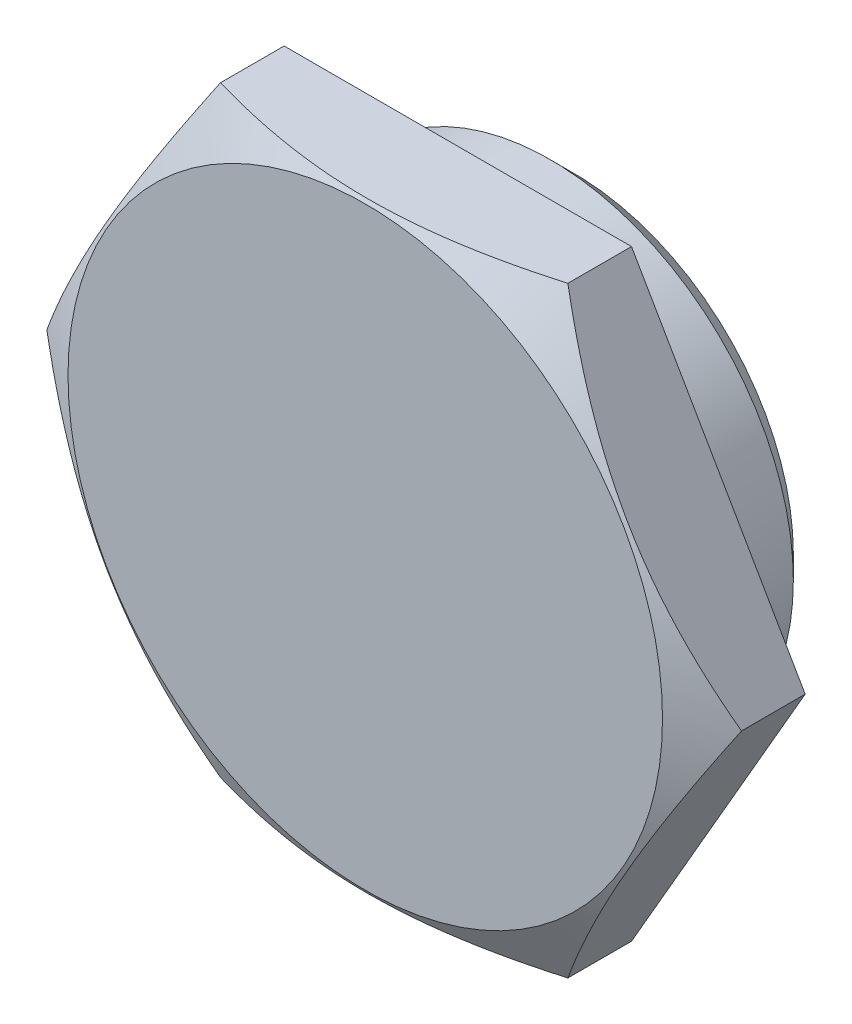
ISO-10303-21;
HEADER;
FILE_DESCRIPTION(('STEP AP214'),'2;1');
FILE_NAME('part.step','',(''),(''),'','','');
FILE_SCHEMA(('AUTOMOTIVE_DESIGN { 1 0 10303 214 1 1 1 1 }'));
ENDSEC;
DATA;
#1=APPLICATION_CONTEXT('core data for automotive mechanical design processes');
#2=APPLICATION_PROTOCOL_DEFINITION('international standard','automotive_design',2000,#1);
#3=PRODUCT_CONTEXT('',#1,'mechanical');
#4=PRODUCT('Part','Part','',(#3));
#5=PRODUCT_RELATED_PRODUCT_CATEGORY('part','',(#4));
#6=PRODUCT_DEFINITION_FORMATION('','',#4);
#7=PRODUCT_DEFINITION_CONTEXT('part definition',#1,'design');
#8=PRODUCT_DEFINITION('design','',#6,#7);
#9=PRODUCT_DEFINITION_SHAPE('','',#8);
#10=(LENGTH_UNIT() NAMED_UNIT(*) SI_UNIT(.MILLI.,.METRE.));
#11=(NAMED_UNIT(*) PLANE_ANGLE_UNIT() SI_UNIT($,.RADIAN.));
#12=(NAMED_UNIT(*) SI_UNIT($,.STERADIAN.) SOLID_ANGLE_UNIT());
#13=UNCERTAINTY_MEASURE_WITH_UNIT(LENGTH_MEASURE(1.E-05),#10,'distance_accuracy_value','');
#14=(GEOMETRIC_REPRESENTATION_CONTEXT(3) GLOBAL_UNCERTAINTY_ASSIGNED_CONTEXT((#13)) GLOBAL_UNIT_ASSIGNED_CONTEXT((#10,
#11,#12)) REPRESENTATION_CONTEXT('',''));
#15=CARTESIAN_POINT('',(0.,0.,0.));
#16=DIRECTION('',(0.,0.,1.));
#17=DIRECTION('',(1.,0.,0.));
#18=AXIS2_PLACEMENT_3D('',#15,#16,#17);
#19=CARTESIAN_POINT('',(-15.0111069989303,25.9999999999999,0.));
#20=DIRECTION('',(0.,0.,-1.));
#21=DIRECTION('',(-1.,0.,0.));
#22=AXIS2_PLACEMENT_3D('',#19,#20,#21);
#23=PLANE('',#22);
#24=DIRECTION('',(-0.5,-0.866025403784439,0.));
#25=VECTOR('',#24,1.);
#26=CARTESIAN_POINT('',(-15.0111069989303,25.9999999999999,0.));
#27=LINE('',#26,#25);
#28=CARTESIAN_POINT('',(-15.0111069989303,25.9999999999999,0.));
#29=VERTEX_POINT('',#28);
#30=CARTESIAN_POINT('',(-30.0222139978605,-8.47217555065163E-13,0.));
#31=VERTEX_POINT('',#30);
#32=EDGE_CURVE('E88',#29,#31,#27,.T.);
#33=ORIENTED_EDGE('',*,*,#32,.F.);
#34=DIRECTION('',(-1.,0.,0.));
#35=VECTOR('',#34,1.);
#36=CARTESIAN_POINT('',(15.0111069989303,26.,-1.48492329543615E-12));
#37=LINE('',#36,#35);
#38=CARTESIAN_POINT('',(15.0111069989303,26.,-1.48492329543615E-12));
#39=VERTEX_POINT('',#38);
#40=EDGE_CURVE('E117',#39,#29,#37,.T.);
#41=ORIENTED_EDGE('',*,*,#40,.F.);
#42=DIRECTION('',(-0.50000000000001,0.866025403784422,0.));
#43=VECTOR('',#42,1.);
#44=CARTESIAN_POINT('',(30.022213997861,7.46993319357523E-13,0.));
#45=LINE('',#44,#43);
#46=CARTESIAN_POINT('',(30.022213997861,7.46993319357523E-13,0.));
#47=VERTEX_POINT('',#46);
#48=EDGE_CURVE('E114',#47,#39,#45,.T.);
#49=ORIENTED_EDGE('',*,*,#48,.F.);
#50=DIRECTION('',(0.5,0.866025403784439,0.));
#51=VECTOR('',#50,1.);
#52=CARTESIAN_POINT('',(15.0111069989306,-25.9999999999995,0.));
#53=LINE('',#52,#51);
#54=CARTESIAN_POINT('',(15.0111069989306,-25.9999999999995,0.));
#55=VERTEX_POINT('',#54);
#56=EDGE_CURVE('E111',#55,#47,#53,.T.);
#57=ORIENTED_EDGE('',*,*,#56,.F.);
#58=DIRECTION('',(1.,0.,0.));
#59=VECTOR('',#58,1.);
#60=CARTESIAN_POINT('',(-15.0111069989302,-26.,1.48492329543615E-12));
#61=LINE('',#60,#59);
#62=CARTESIAN_POINT('',(-15.0111069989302,-26.,1.48492329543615E-12));
#63=VERTEX_POINT('',#62);
#64=EDGE_CURVE('E102',#63,#55,#61,.T.);
#65=ORIENTED_EDGE('',*,*,#64,.F.);
#66=DIRECTION('',(0.50000000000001,-0.866025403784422,0.));
#67=VECTOR('',#66,1.);
#68=CARTESIAN_POINT('',(-30.0222139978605,-8.47217555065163E-13,0.));
#69=LINE('',#68,#67);
#70=EDGE_CURVE('E100',#31,#63,#69,.T.);
#71=ORIENTED_EDGE('',*,*,#70,.F.);
#72=EDGE_LOOP('',(#33,#41,#49,#57,#65,#71));
#73=FACE_BOUND('',#72,.T.);
#74=CARTESIAN_POINT('',(0.,0.,0.));
#75=DIRECTION('',(0.,0.,1.));
#76=DIRECTION('',(1.,0.,0.));
#77=AXIS2_PLACEMENT_3D('',#74,#75,#76);
#78=CIRCLE('',#77,19.);
#79=CARTESIAN_POINT('',(19.,5.21027665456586E-13,0.));
#80=VERTEX_POINT('',#79);
#81=EDGE_CURVE('E301',#80,#80,#78,.T.);
#82=ORIENTED_EDGE('',*,*,#81,.T.);
#83=EDGE_LOOP('',(#82));
#84=FACE_BOUND('',#83,.T.);
#85=ADVANCED_FACE('F29',(#73,#84),#23,.T.);
#86=CARTESIAN_POINT('',(-15.0111069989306,25.9999999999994,7.99999999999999));
#87=DIRECTION('',(0.866025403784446,-0.499999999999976,0.));
#88=DIRECTION('',(0.5,0.866025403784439,0.));
#89=AXIS2_PLACEMENT_3D('',#86,#87,#88);
#90=PLANE('',#89);
#91=DIRECTION('',(0.,0.,-1.));
#92=VECTOR('',#91,1.);
#93=CARTESIAN_POINT('',(-30.0222139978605,-9.37423175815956E-13,8.00000000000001));
#94=LINE('',#93,#92);
#95=CARTESIAN_POINT('',(-30.0222139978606,-9.44362069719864E-13,5.50000000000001));
#96=VERTEX_POINT('',#95);
#97=EDGE_CURVE('E11',#96,#31,#94,.T.);
#98=ORIENTED_EDGE('',*,*,#97,.F.);
#99=CARTESIAN_POINT('',(-30.0223294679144,-0.000200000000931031,5.49993333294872));
#100=CARTESIAN_POINT('',(-29.6923919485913,0.571268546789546,5.69040876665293));
#101=CARTESIAN_POINT('',(-29.3611674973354,1.14496612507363,5.87224064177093));
#102=CARTESIAN_POINT('',(-28.6960625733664,2.2969616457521,6.21621468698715));
#103=CARTESIAN_POINT('',(-28.3621812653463,2.87526103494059,6.37835038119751));
#104=CARTESIAN_POINT('',(-27.6911102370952,4.03759015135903,6.68075581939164));
#105=CARTESIAN_POINT('',(-27.3539145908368,4.62163014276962,6.82097334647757));
#106=CARTESIAN_POINT('',(-26.6771945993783,5.79374355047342,7.07652184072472));
#107=CARTESIAN_POINT('',(-26.3376704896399,6.381816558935,7.19185528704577));
#108=CARTESIAN_POINT('',(-25.6649720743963,7.54696439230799,7.39273988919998));
#109=CARTESIAN_POINT('',(-25.3318476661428,8.12395279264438,7.4789553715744));
#110=CARTESIAN_POINT('',(-24.6640724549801,9.28057338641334,7.62351895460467));
#111=CARTESIAN_POINT('',(-24.3294216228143,9.86020563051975,7.68186651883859));
#112=CARTESIAN_POINT('',(-23.6595578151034,11.0204437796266,7.76922101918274));
#113=CARTESIAN_POINT('',(-23.324345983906,11.6010477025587,7.79826282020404));
#114=CARTESIAN_POINT('',(-22.6536129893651,12.7627913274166,7.82638125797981));
#115=CARTESIAN_POINT('',(-22.3180918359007,13.3439310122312,7.825458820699));
#116=CARTESIAN_POINT('',(-21.6908304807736,14.4303795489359,7.79574173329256));
#117=CARTESIAN_POINT('',(-21.39904560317,14.9357657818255,7.77057081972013));
#118=CARTESIAN_POINT('',(-20.816172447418,15.9453317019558,7.69804504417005));
#119=CARTESIAN_POINT('',(-20.5250841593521,16.4495114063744,7.65069049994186));
#120=CARTESIAN_POINT('',(-19.9437117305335,17.4564779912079,7.53461816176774));
#121=CARTESIAN_POINT('',(-19.6534285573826,17.9592631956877,7.46588104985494));
#122=CARTESIAN_POINT('',(-19.0742521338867,18.9624261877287,7.30826009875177));
#123=CARTESIAN_POINT('',(-18.7853588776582,19.4628039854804,7.21937634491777));
#124=CARTESIAN_POINT('',(-17.9083405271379,20.981844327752,6.92022406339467));
#125=CARTESIAN_POINT('',(-17.3227071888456,21.9961910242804,6.68011052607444));
#126=CARTESIAN_POINT('',(-16.4507245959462,23.5065091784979,6.27132858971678));
#127=CARTESIAN_POINT('',(-16.1613914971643,24.0076488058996,6.12711310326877));
#128=CARTESIAN_POINT('',(-15.5847265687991,25.0064617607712,5.82408210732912));
#129=CARTESIAN_POINT('',(-15.2973941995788,25.5041360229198,5.66527071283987));
#130=CARTESIAN_POINT('',(-15.0109915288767,26.0001999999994,5.49993333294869));
#131=B_SPLINE_CURVE_WITH_KNOTS('',3,(#99,#100,#101,#102,#103,#104,#105,#106,#107,#108,#109,#110,
#111,#112,#113,#114,#115,#116,#117,#118,#119,#120,#121,#122,#123,#124,#125,#126,#127,#128,#129,
#130),.UNSPECIFIED.,.F.,.F.,(4,2,2,2,2,2,2,2,2,2,2,2,2,2,2,4),(0.,2.06050133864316,
4.12167832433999,6.18769329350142,8.25350233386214,10.2683658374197,12.28326812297,
14.2957704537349,16.3082105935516,18.0601245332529,19.8120133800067,21.5654895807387,
23.3189583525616,26.9031329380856,28.6920983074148,30.4805608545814),.UNSPECIFIED.);
#132=CARTESIAN_POINT('',(-15.0111069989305,25.9999999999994,5.49999999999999));
#133=VERTEX_POINT('',#132);
#134=EDGE_CURVE('E81',#96,#133,#131,.T.);
#135=ORIENTED_EDGE('',*,*,#134,.T.);
#136=DIRECTION('',(0.,0.,-1.));
#137=VECTOR('',#136,1.);
#138=CARTESIAN_POINT('',(-15.0111069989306,25.9999999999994,7.99999999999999));
#139=LINE('',#138,#137);
#140=EDGE_CURVE('E53',#133,#29,#139,.T.);
#141=ORIENTED_EDGE('',*,*,#140,.T.);
#142=ORIENTED_EDGE('',*,*,#32,.T.);
#143=EDGE_LOOP('',(#98,#135,#141,#142));
#144=FACE_BOUND('',#143,.T.);
#145=ADVANCED_FACE('F31',(#144),#90,.F.);
#146=CARTESIAN_POINT('',(-30.0222139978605,-9.37423175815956E-13,8.00000000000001));
#147=DIRECTION('',(0.866025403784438,0.500000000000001,0.));
#148=DIRECTION('',(-0.50000000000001,0.866025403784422,0.));
#149=AXIS2_PLACEMENT_3D('',#146,#147,#148);
#150=PLANE('',#149);
#151=DIRECTION('',(0.,0.,-1.));
#152=VECTOR('',#151,1.);
#153=CARTESIAN_POINT('',(-15.0111069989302,-26.,8.00000000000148));
#154=LINE('',#153,#152);
#155=CARTESIAN_POINT('',(-15.0111069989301,-26.,5.50000000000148));
#156=VERTEX_POINT('',#155);
#157=EDGE_CURVE('E38',#156,#63,#154,.T.);
#158=ORIENTED_EDGE('',*,*,#157,.F.);
#159=CARTESIAN_POINT('',(-15.0109915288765,-26.0002000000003,5.49993333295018));
#160=CARTESIAN_POINT('',(-15.3409290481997,-25.4287314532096,5.69040876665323));
#161=CARTESIAN_POINT('',(-15.6721534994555,-24.8550338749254,5.87224064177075));
#162=CARTESIAN_POINT('',(-16.3372584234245,-23.7030383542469,6.21621468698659));
#163=CARTESIAN_POINT('',(-16.6711397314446,-23.1247389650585,6.37835038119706));
#164=CARTESIAN_POINT('',(-17.3422107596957,-21.9624098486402,6.68075581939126));
#165=CARTESIAN_POINT('',(-17.6794064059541,-21.3783698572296,6.82097334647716));
#166=CARTESIAN_POINT('',(-18.3561263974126,-20.2062564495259,7.07652184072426));
#167=CARTESIAN_POINT('',(-18.6956505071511,-19.6181834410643,7.19185528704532));
#168=CARTESIAN_POINT('',(-19.3683489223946,-18.4530356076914,7.39273988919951));
#169=CARTESIAN_POINT('',(-19.7014733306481,-17.876047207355,7.47895537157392));
#170=CARTESIAN_POINT('',(-20.3692485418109,-16.7194266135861,7.6235189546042));
#171=CARTESIAN_POINT('',(-20.7038993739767,-16.1397943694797,7.68186651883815));
#172=CARTESIAN_POINT('',(-21.3737631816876,-14.9795562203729,7.76922101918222));
#173=CARTESIAN_POINT('',(-21.7089750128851,-14.3989522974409,7.79826282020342));
#174=CARTESIAN_POINT('',(-22.3797080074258,-13.237208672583,7.82638125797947));
#175=CARTESIAN_POINT('',(-22.71522916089,-12.6560689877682,7.82545882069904));
#176=CARTESIAN_POINT('',(-23.3424905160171,-11.5696204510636,7.79574173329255));
#177=CARTESIAN_POINT('',(-23.6342753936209,-11.0642342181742,7.77057081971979));
#178=CARTESIAN_POINT('',(-24.217148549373,-10.054668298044,7.69804504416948));
#179=CARTESIAN_POINT('',(-24.5082368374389,-9.55048859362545,7.65069049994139));
#180=CARTESIAN_POINT('',(-25.0896092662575,-8.54352200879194,7.53461816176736));
#181=CARTESIAN_POINT('',(-25.3798924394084,-8.04073680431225,7.46588104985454));
#182=CARTESIAN_POINT('',(-25.9590688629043,-7.03757381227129,7.30826009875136));
#183=CARTESIAN_POINT('',(-26.2479621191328,-6.5371960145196,7.21937634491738));
#184=CARTESIAN_POINT('',(-27.1249804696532,-5.01815567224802,6.92022406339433));
#185=CARTESIAN_POINT('',(-27.7106138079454,-4.00380897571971,6.68011052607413));
#186=CARTESIAN_POINT('',(-28.5825964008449,-2.49349082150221,6.27132858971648));
#187=CARTESIAN_POINT('',(-28.8719294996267,-1.99235119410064,6.12711310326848));
#188=CARTESIAN_POINT('',(-29.448594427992,-0.993538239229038,5.82408210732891));
#189=CARTESIAN_POINT('',(-29.7359267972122,-0.495863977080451,5.66527071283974));
#190=CARTESIAN_POINT('',(-30.0223294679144,0.000199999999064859,5.49993333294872));
#191=B_SPLINE_CURVE_WITH_KNOTS('',3,(#159,#160,#161,#162,#163,#164,#165,#166,#167,#168,#169,
#170,#171,#172,#173,#174,#175,#176,#177,#178,#179,#180,#181,#182,#183,#184,#185,#186,#187,#188,
#189,#190),.UNSPECIFIED.,.F.,.F.,(4,2,2,2,2,2,2,2,2,2,2,2,2,2,2,4),(0.,2.06050133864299,
4.12167832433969,6.18769329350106,8.25350233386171,10.2683658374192,12.2832681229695,
14.2957704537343,16.3082105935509,18.0601245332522,19.8120133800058,21.5654895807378,
23.3189583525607,26.9031329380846,28.6920983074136,30.4805608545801),.UNSPECIFIED.);
#192=EDGE_CURVE('E84',#156,#96,#191,.T.);
#193=ORIENTED_EDGE('',*,*,#192,.T.);
#194=ORIENTED_EDGE('',*,*,#97,.T.);
#195=ORIENTED_EDGE('',*,*,#70,.T.);
#196=EDGE_LOOP('',(#158,#193,#194,#195));
#197=FACE_BOUND('',#196,.T.);
#198=ADVANCED_FACE('F92',(#197),#150,.F.);
#199=CARTESIAN_POINT('',(-15.0111069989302,-26.,8.00000000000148));
#200=DIRECTION('',(0.,1.,0.));
#201=DIRECTION('',(-1.,0.,0.));
#202=AXIS2_PLACEMENT_3D('',#199,#200,#201);
#203=PLANE('',#202);
#204=DIRECTION('',(0.,0.,-1.));
#205=VECTOR('',#204,1.);
#206=CARTESIAN_POINT('',(15.0111069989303,-26.,8.00000000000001));
#207=LINE('',#206,#205);
#208=CARTESIAN_POINT('',(15.0111069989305,-25.9999999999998,5.50000000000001));
#209=VERTEX_POINT('',#208);
#210=EDGE_CURVE('E124',#209,#55,#207,.T.);
#211=ORIENTED_EDGE('',*,*,#210,.F.);
#212=CARTESIAN_POINT('',(-39.7870157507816,-26.,-4.60755235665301));
#213=CARTESIAN_POINT('',(-39.2163596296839,-26.0000000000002,-4.33175941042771));
#214=CARTESIAN_POINT('',(-38.6450125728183,-26.0000000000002,-4.05739160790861));
#215=CARTESIAN_POINT('',(-37.5007916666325,-26.0000000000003,-3.51184284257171));
#216=CARTESIAN_POINT('',(-36.9279178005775,-26.0000000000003,-3.24066191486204));
#217=CARTESIAN_POINT('',(-35.7804133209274,-26.0000000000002,-2.70178370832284));
#218=CARTESIAN_POINT('',(-35.2057824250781,-26.0000000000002,-2.4340870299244));
#219=CARTESIAN_POINT('',(-34.0547057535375,-26.0000000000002,-1.9026302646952));
#220=CARTESIAN_POINT('',(-33.4782599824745,-26.0000000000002,-1.63887016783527));
#221=CARTESIAN_POINT('',(-31.7393207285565,-26.0000000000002,-0.851154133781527));
#222=CARTESIAN_POINT('',(-30.573796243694,-26.0000000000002,-0.333860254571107));
#223=CARTESIAN_POINT('',(-28.2331544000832,-26.0000000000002,0.678503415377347));
#224=CARTESIAN_POINT('',(-27.0580375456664,-26.0000000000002,1.17357436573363));
#225=CARTESIAN_POINT('',(-25.279525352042,-26.0000000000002,1.89791160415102));
#226=CARTESIAN_POINT('',(-24.6804083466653,-26.0000000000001,2.13769377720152));
#227=CARTESIAN_POINT('',(-23.4789523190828,-26.0000000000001,2.60903471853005));
#228=CARTESIAN_POINT('',(-22.8766133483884,-26.0000000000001,2.84059361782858));
#229=CARTESIAN_POINT('',(-21.6683414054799,-26.0000000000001,3.29442752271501));
#230=CARTESIAN_POINT('',(-21.0624079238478,-26.0000000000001,3.5167011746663));
#231=CARTESIAN_POINT('',(-19.8467710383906,-26.0000000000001,3.95065954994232));
#232=CARTESIAN_POINT('',(-19.2370677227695,-26.0000000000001,4.16234451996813));
#233=CARTESIAN_POINT('',(-18.0149145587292,-26.0000000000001,4.57325941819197));
#234=CARTESIAN_POINT('',(-17.4024734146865,-26.0000000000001,4.7725151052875));
#235=CARTESIAN_POINT('',(-16.1733510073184,-26.0000000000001,5.15744780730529));
#236=CARTESIAN_POINT('',(-15.5566696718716,-26.0000000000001,5.34312459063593));
#237=CARTESIAN_POINT('',(-13.7002729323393,-26.0000000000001,5.87705908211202));
#238=CARTESIAN_POINT('',(-12.4537331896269,-26.,6.20238226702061));
#239=CARTESIAN_POINT('',(-10.5705591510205,-26.,6.6324638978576));
#240=CARTESIAN_POINT('',(-9.94046791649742,-26.,6.7661968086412));
#241=CARTESIAN_POINT('',(-8.67609132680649,-26.0000000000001,7.0122469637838));
#242=CARTESIAN_POINT('',(-8.04180606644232,-26.0000000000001,7.12456469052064));
#243=CARTESIAN_POINT('',(-6.76947587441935,-26.,7.32579174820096));
#244=CARTESIAN_POINT('',(-6.13143071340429,-26.,7.41469963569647));
#245=CARTESIAN_POINT('',(-4.8523119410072,-26.,7.56732047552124));
#246=CARTESIAN_POINT('',(-4.21123832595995,-26.,7.63103339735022));
#247=CARTESIAN_POINT('',(-2.93105337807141,-26.,7.73155041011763));
#248=CARTESIAN_POINT('',(-2.29195530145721,-26.,7.76852224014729));
#249=CARTESIAN_POINT('',(-1.0127697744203,-26.,7.81536304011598));
#250=CARTESIAN_POINT('',(-0.372682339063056,-26.,7.82523241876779));
#251=CARTESIAN_POINT('',(0.90715618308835,-26.,7.81763445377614));
#252=CARTESIAN_POINT('',(1.54690731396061,-26.,7.80017464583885));
#253=CARTESIAN_POINT('',(2.8251130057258,-26.,7.73835145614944));
#254=CARTESIAN_POINT('',(3.46356750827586,-26.,7.69398688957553));
#255=CARTESIAN_POINT('',(5.01130096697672,-26.,7.55475140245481));
#256=CARTESIAN_POINT('',(5.91938555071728,-26.,7.44638372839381));
#257=CARTESIAN_POINT('',(7.72847155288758,-26.0000000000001,7.18125372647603));
#258=CARTESIAN_POINT('',(8.62947189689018,-26.,7.02448419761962));
#259=CARTESIAN_POINT('',(10.4248538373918,-26.,6.66788380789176));
#260=CARTESIAN_POINT('',(11.3192169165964,-26.0000000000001,6.46796059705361));
#261=CARTESIAN_POINT('',(13.0987786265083,-26.0000000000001,6.03125964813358));
#262=CARTESIAN_POINT('',(13.983977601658,-26.0000000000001,5.79448330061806));
#263=CARTESIAN_POINT('',(15.7660233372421,-26.0000000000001,5.2838316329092));
#264=CARTESIAN_POINT('',(16.6626567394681,-26.0000000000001,5.00921678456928));
#265=CARTESIAN_POINT('',(18.4471394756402,-26.0000000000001,4.43269872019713));
#266=CARTESIAN_POINT('',(19.3349880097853,-26.0000000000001,4.13079304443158));
#267=CARTESIAN_POINT('',(21.0976305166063,-26.0000000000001,3.50607554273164));
#268=CARTESIAN_POINT('',(21.9724698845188,-26.,3.18339130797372));
#269=CARTESIAN_POINT('',(23.2792156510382,-26.0000000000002,2.68542157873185));
#270=CARTESIAN_POINT('',(23.7138094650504,-26.0000000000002,2.51713586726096));
#271=CARTESIAN_POINT('',(24.581306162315,-26.,2.17629484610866));
#272=CARTESIAN_POINT('',(25.0142090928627,-25.9999999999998,2.00373965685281));
#273=CARTESIAN_POINT('',(25.4463283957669,-25.9999999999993,1.82924143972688));
#274=B_SPLINE_CURVE_WITH_KNOTS('',3,(#212,#213,#214,#215,#216,#217,#218,#219,#220,#221,#222,
#223,#224,#225,#226,#227,#228,#229,#230,#231,#232,#233,#234,#235,#236,#237,#238,#239,#240,#241,
#242,#243,#244,#245,#246,#247,#248,#249,#250,#251,#252,#253,#254,#255,#256,#257,#258,#259,#260,
#261,#262,#263,#264,#265,#266,#267,#268,#269,#270,#271,#272,#273),.UNSPECIFIED.,.F.,.F.,(4,2,2,
2,2,2,2,2,2,2,2,2,2,2,2,2,2,2,2,2,2,2,2,2,2,2,2,2,2,2,4),(0.,1.90141907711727,3.8028590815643,
5.70462252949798,7.60638113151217,11.4316898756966,15.256798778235,17.1927067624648,
19.1285838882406,21.0647422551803,23.0008554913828,24.932812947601,26.8648033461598,
30.7272901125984,32.659378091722,34.5914225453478,36.5235861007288,38.4557519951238,
40.3756903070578,42.2955996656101,44.2149797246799,46.134444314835,48.8765007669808,
51.6189653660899,54.3673581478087,57.1156472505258,59.928358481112,62.7413234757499,
65.5384144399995,66.9365117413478,68.334569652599),.UNSPECIFIED.);
#275=EDGE_CURVE('E95',#209,#156,#274,.F.);
#276=ORIENTED_EDGE('',*,*,#275,.T.);
#277=ORIENTED_EDGE('',*,*,#157,.T.);
#278=ORIENTED_EDGE('',*,*,#64,.T.);
#279=EDGE_LOOP('',(#211,#276,#277,#278));
#280=FACE_BOUND('',#279,.T.);
#281=ADVANCED_FACE('F127',(#280),#203,.F.);
#282=CARTESIAN_POINT('',(15.0111069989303,-26.,8.00000000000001));
#283=DIRECTION('',(-0.866025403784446,0.499999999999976,0.));
#284=DIRECTION('',(-0.5,-0.866025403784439,0.));
#285=AXIS2_PLACEMENT_3D('',#282,#283,#284);
#286=PLANE('',#285);
#287=DIRECTION('',(0.,0.,-1.));
#288=VECTOR('',#287,1.);
#289=CARTESIAN_POINT('',(30.022213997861,6.98421062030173E-13,7.99999999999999));
#290=LINE('',#289,#288);
#291=CARTESIAN_POINT('',(30.0222139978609,9.06587879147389E-13,5.49999999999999));
#292=VERTEX_POINT('',#291);
#293=EDGE_CURVE('E122',#292,#47,#290,.T.);
#294=ORIENTED_EDGE('',*,*,#293,.F.);
#295=CARTESIAN_POINT('',(30.0223294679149,0.000200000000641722,5.49993333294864));
#296=CARTESIAN_POINT('',(29.6923919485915,-0.571268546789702,5.69040876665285));
#297=CARTESIAN_POINT('',(29.3611674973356,-1.14496612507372,5.87224064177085));
#298=CARTESIAN_POINT('',(28.6960625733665,-2.29696164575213,6.21621468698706));
#299=CARTESIAN_POINT('',(28.3621812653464,-2.87526103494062,6.37835038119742));
#300=CARTESIAN_POINT('',(27.6911102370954,-4.03759015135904,6.68075581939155));
#301=CARTESIAN_POINT('',(27.353914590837,-4.62163014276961,6.82097334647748));
#302=CARTESIAN_POINT('',(26.6771945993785,-5.79374355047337,7.07652184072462));
#303=CARTESIAN_POINT('',(26.3376704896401,-6.38181655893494,7.19185528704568));
#304=CARTESIAN_POINT('',(25.6649720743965,-7.54696439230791,7.39273988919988));
#305=CARTESIAN_POINT('',(25.331847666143,-8.12395279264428,7.47895537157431));
#306=CARTESIAN_POINT('',(24.6640724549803,-9.28057338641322,7.62351895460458));
#307=CARTESIAN_POINT('',(24.3294216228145,-9.86020563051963,7.6818665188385));
#308=CARTESIAN_POINT('',(23.6595578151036,-11.0204437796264,7.76922101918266));
#309=CARTESIAN_POINT('',(23.3243459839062,-11.6010477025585,7.79826282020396));
#310=CARTESIAN_POINT('',(22.6536129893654,-12.7627913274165,7.82638125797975));
#311=CARTESIAN_POINT('',(22.3180918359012,-13.3439310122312,7.82545882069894));
#312=CARTESIAN_POINT('',(21.690830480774,-14.4303795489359,7.79574173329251));
#313=CARTESIAN_POINT('',(21.3990456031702,-14.9357657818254,7.77057081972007));
#314=CARTESIAN_POINT('',(20.8161724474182,-15.9453317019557,7.69804504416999));
#315=CARTESIAN_POINT('',(20.5250841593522,-16.4495114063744,7.6506904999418));
#316=CARTESIAN_POINT('',(19.9437117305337,-17.456477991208,7.53461816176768));
#317=CARTESIAN_POINT('',(19.6534285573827,-17.9592631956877,7.46588104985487));
#318=CARTESIAN_POINT('',(19.0742521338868,-18.9624261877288,7.30826009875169));
#319=CARTESIAN_POINT('',(18.7853588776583,-19.4628039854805,7.21937634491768));
#320=CARTESIAN_POINT('',(17.9083405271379,-20.9818443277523,6.92022406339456));
#321=CARTESIAN_POINT('',(17.3227071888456,-21.9961910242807,6.68011052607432));
#322=CARTESIAN_POINT('',(16.4507245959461,-23.5065091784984,6.2713285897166));
#323=CARTESIAN_POINT('',(16.1613914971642,-24.0076488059,6.12711310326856));
#324=CARTESIAN_POINT('',(15.584726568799,-25.0064617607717,5.82408210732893));
#325=CARTESIAN_POINT('',(15.2973941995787,-25.5041360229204,5.66527071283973));
#326=CARTESIAN_POINT('',(15.0109915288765,-26.0002,5.49993333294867));
#327=B_SPLINE_CURVE_WITH_KNOTS('',3,(#295,#296,#297,#298,#299,#300,#301,#302,#303,#304,#305,
#306,#307,#308,#309,#310,#311,#312,#313,#314,#315,#316,#317,#318,#319,#320,#321,#322,#323,#324,
#325,#326),.UNSPECIFIED.,.F.,.F.,(4,2,2,2,2,2,2,2,2,2,2,2,2,2,2,4),(0.,2.06050133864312,
4.1216783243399,6.18769329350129,8.25350233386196,10.2683658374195,12.2832681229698,
14.2957704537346,16.3082105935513,18.0601245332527,19.8120133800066,21.5654895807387,
23.3189583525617,26.903132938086,28.6920983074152,30.4805608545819),.UNSPECIFIED.);
#328=EDGE_CURVE('E136',#292,#209,#327,.T.);
#329=ORIENTED_EDGE('',*,*,#328,.T.);
#330=ORIENTED_EDGE('',*,*,#210,.T.);
#331=ORIENTED_EDGE('',*,*,#56,.T.);
#332=EDGE_LOOP('',(#294,#329,#330,#331));
#333=FACE_BOUND('',#332,.T.);
#334=ADVANCED_FACE('F134',(#333),#286,.F.);
#335=CARTESIAN_POINT('',(30.022213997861,6.98421062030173E-13,7.99999999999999));
#336=DIRECTION('',(-0.866025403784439,-0.500000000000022,0.));
#337=DIRECTION('',(0.50000000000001,-0.866025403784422,0.));
#338=AXIS2_PLACEMENT_3D('',#335,#336,#337);
#339=PLANE('',#338);
#340=DIRECTION('',(0.,0.,-1.));
#341=VECTOR('',#340,1.);
#342=CARTESIAN_POINT('',(15.0111069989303,26.,7.99999999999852));
#343=LINE('',#342,#341);
#344=CARTESIAN_POINT('',(15.0111069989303,26.,5.49999999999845));
#345=VERTEX_POINT('',#344);
#346=EDGE_CURVE('E120',#345,#39,#343,.T.);
#347=ORIENTED_EDGE('',*,*,#346,.F.);
#348=CARTESIAN_POINT('',(15.0109915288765,26.0002,5.49993333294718));
#349=CARTESIAN_POINT('',(15.3409290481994,25.4287314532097,5.69040876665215));
#350=CARTESIAN_POINT('',(15.6721534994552,24.8550338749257,5.87224064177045));
#351=CARTESIAN_POINT('',(16.3372584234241,23.7030383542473,6.21621468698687));
#352=CARTESIAN_POINT('',(16.6711397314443,23.1247389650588,6.37835038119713));
#353=CARTESIAN_POINT('',(17.3422107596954,21.9624098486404,6.68075581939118));
#354=CARTESIAN_POINT('',(17.6794064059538,21.3783698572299,6.82097334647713));
#355=CARTESIAN_POINT('',(18.3561263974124,20.2062564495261,7.07652184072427));
#356=CARTESIAN_POINT('',(18.6956505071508,19.6181834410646,7.19185528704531));
#357=CARTESIAN_POINT('',(19.3683489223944,18.4530356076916,7.39273988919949));
#358=CARTESIAN_POINT('',(19.7014733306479,17.8760472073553,7.4789553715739));
#359=CARTESIAN_POINT('',(20.3692485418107,16.7194266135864,7.62351895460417));
#360=CARTESIAN_POINT('',(20.7038993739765,16.1397943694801,7.68186651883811));
#361=CARTESIAN_POINT('',(21.3737631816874,14.9795562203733,7.76922101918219));
#362=CARTESIAN_POINT('',(21.7089750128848,14.3989522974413,7.7982628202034));
#363=CARTESIAN_POINT('',(22.3797080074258,13.2372086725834,7.82638125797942));
#364=CARTESIAN_POINT('',(22.7152291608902,12.6560689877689,7.82545882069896));
#365=CARTESIAN_POINT('',(23.3424905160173,11.5696204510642,7.79574173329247));
#366=CARTESIAN_POINT('',(23.6342753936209,11.0642342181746,7.77057081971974));
#367=CARTESIAN_POINT('',(24.2171485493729,10.0546682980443,7.69804504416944));
#368=CARTESIAN_POINT('',(24.5082368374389,9.55048859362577,7.65069049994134));
#369=CARTESIAN_POINT('',(25.0896092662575,8.54352200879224,7.53461816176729));
#370=CARTESIAN_POINT('',(25.3798924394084,8.04073680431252,7.46588104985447));
#371=CARTESIAN_POINT('',(25.9590688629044,7.03757381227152,7.30826009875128));
#372=CARTESIAN_POINT('',(26.2479621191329,6.53719601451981,7.21937634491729));
#373=CARTESIAN_POINT('',(27.1249804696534,5.01815567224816,6.92022406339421));
#374=CARTESIAN_POINT('',(27.7106138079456,4.00380897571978,6.680110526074));
#375=CARTESIAN_POINT('',(28.5825964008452,2.4934908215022,6.27132858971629));
#376=CARTESIAN_POINT('',(28.8719294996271,1.9923511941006,6.12711310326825));
#377=CARTESIAN_POINT('',(29.4485944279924,0.99353823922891,5.82408210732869));
#378=CARTESIAN_POINT('',(29.7359267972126,0.495863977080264,5.66527071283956));
#379=CARTESIAN_POINT('',(30.0223294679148,-0.000199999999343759,5.49993333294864));
#380=B_SPLINE_CURVE_WITH_KNOTS('',3,(#348,#349,#350,#351,#352,#353,#354,#355,#356,#357,#358,
#359,#360,#361,#362,#363,#364,#365,#366,#367,#368,#369,#370,#371,#372,#373,#374,#375,#376,#377,
#378,#379),.UNSPECIFIED.,.F.,.F.,(4,2,2,2,2,2,2,2,2,2,2,2,2,2,2,4),(0.,2.06050133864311,
4.12167832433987,6.18769329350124,8.25350233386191,10.2683658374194,12.2832681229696,
14.2957704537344,16.308210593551,18.0601245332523,19.8120133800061,21.5654895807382,
23.3189583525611,26.9031329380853,28.6920983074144,30.480560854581),.UNSPECIFIED.);
#381=EDGE_CURVE('E45',#345,#292,#380,.T.);
#382=ORIENTED_EDGE('',*,*,#381,.T.);
#383=ORIENTED_EDGE('',*,*,#293,.T.);
#384=ORIENTED_EDGE('',*,*,#48,.T.);
#385=EDGE_LOOP('',(#347,#382,#383,#384));
#386=FACE_BOUND('',#385,.T.);
#387=ADVANCED_FACE('F184',(#386),#339,.F.);
#388=CARTESIAN_POINT('',(15.0111069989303,26.,7.99999999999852));
#389=DIRECTION('',(0.,-1.,0.));
#390=DIRECTION('',(0.,0.,-1.));
#391=AXIS2_PLACEMENT_3D('',#388,#389,#390);
#392=PLANE('',#391);
#393=ORIENTED_EDGE('',*,*,#140,.F.);
#394=CARTESIAN_POINT('',(-39.7870157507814,25.999999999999,-4.60755235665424));
#395=CARTESIAN_POINT('',(-39.2163596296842,25.9999999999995,-4.33175941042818));
#396=CARTESIAN_POINT('',(-38.6450125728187,25.9999999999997,-4.05739160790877));
#397=CARTESIAN_POINT('',(-37.500791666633,25.9999999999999,-3.51184284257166));
#398=CARTESIAN_POINT('',(-36.9279178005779,25.9999999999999,-3.24066191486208));
#399=CARTESIAN_POINT('',(-35.7804133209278,25.9999999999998,-2.70178370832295));
#400=CARTESIAN_POINT('',(-35.2057824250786,25.9999999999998,-2.4340870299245));
#401=CARTESIAN_POINT('',(-34.054705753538,25.9999999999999,-1.90263026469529));
#402=CARTESIAN_POINT('',(-33.478259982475,25.9999999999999,-1.63887016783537));
#403=CARTESIAN_POINT('',(-31.7393207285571,25.9999999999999,-0.851154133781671));
#404=CARTESIAN_POINT('',(-30.5737962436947,25.9999999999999,-0.333860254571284));
#405=CARTESIAN_POINT('',(-28.233154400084,25.9999999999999,0.678503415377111));
#406=CARTESIAN_POINT('',(-27.0580375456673,25.9999999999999,1.17357436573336));
#407=CARTESIAN_POINT('',(-25.279525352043,25.9999999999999,1.89791160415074));
#408=CARTESIAN_POINT('',(-24.6804083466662,25.9999999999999,2.13769377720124));
#409=CARTESIAN_POINT('',(-23.4789523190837,25.9999999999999,2.60903471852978));
#410=CARTESIAN_POINT('',(-22.8766133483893,25.9999999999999,2.84059361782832));
#411=CARTESIAN_POINT('',(-21.6683414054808,25.9999999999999,3.29442752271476));
#412=CARTESIAN_POINT('',(-21.0624079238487,25.9999999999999,3.51670117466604));
#413=CARTESIAN_POINT('',(-19.8467710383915,26.,3.95065954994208));
#414=CARTESIAN_POINT('',(-19.2370677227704,26.,4.1623445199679));
#415=CARTESIAN_POINT('',(-18.0149145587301,26.,4.57325941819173));
#416=CARTESIAN_POINT('',(-17.4024734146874,26.,4.77251510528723));
#417=CARTESIAN_POINT('',(-16.1733510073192,26.,5.15744780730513));
#418=CARTESIAN_POINT('',(-15.5566696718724,26.0000000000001,5.34312459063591));
#419=CARTESIAN_POINT('',(-13.70027293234,25.9999999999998,5.87705908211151));
#420=CARTESIAN_POINT('',(-12.4537331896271,25.9999999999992,6.20238226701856));
#421=CARTESIAN_POINT('',(-10.5705591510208,25.9999999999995,6.63246389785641));
#422=CARTESIAN_POINT('',(-9.94046791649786,25.9999999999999,6.76619680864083));
#423=CARTESIAN_POINT('',(-8.67609132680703,26.0000000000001,7.01224696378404));
#424=CARTESIAN_POINT('',(-8.04180606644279,26.,7.12456469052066));
#425=CARTESIAN_POINT('',(-6.76947587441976,26.,7.32579174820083));
#426=CARTESIAN_POINT('',(-6.13143071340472,26.,7.41469963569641));
#427=CARTESIAN_POINT('',(-4.85231194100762,26.,7.56732047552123));
#428=CARTESIAN_POINT('',(-4.21123832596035,26.,7.63103339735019));
#429=CARTESIAN_POINT('',(-2.93105337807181,26.,7.73155041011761));
#430=CARTESIAN_POINT('',(-2.29195530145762,26.,7.76852224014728));
#431=CARTESIAN_POINT('',(-1.01276977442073,26.,7.81536304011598));
#432=CARTESIAN_POINT('',(-0.372682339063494,26.,7.82523241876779));
#433=CARTESIAN_POINT('',(0.9071561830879,26.,7.81763445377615));
#434=CARTESIAN_POINT('',(1.54690731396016,26.,7.80017464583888));
#435=CARTESIAN_POINT('',(2.82511300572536,26.,7.73835145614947));
#436=CARTESIAN_POINT('',(3.46356750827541,26.,7.69398688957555));
#437=CARTESIAN_POINT('',(5.01130096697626,26.,7.55475140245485));
#438=CARTESIAN_POINT('',(5.91938555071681,26.,7.44638372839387));
#439=CARTESIAN_POINT('',(7.72847155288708,26.,7.18125372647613));
#440=CARTESIAN_POINT('',(8.62947189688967,26.,7.02448419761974));
#441=CARTESIAN_POINT('',(10.4248538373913,26.,6.6678838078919));
#442=CARTESIAN_POINT('',(11.3192169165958,26.,6.46796059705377));
#443=CARTESIAN_POINT('',(13.0987786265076,26.,6.03125964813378));
#444=CARTESIAN_POINT('',(13.9839776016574,26.,5.79448330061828));
#445=CARTESIAN_POINT('',(15.7660233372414,26.,5.28383163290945));
#446=CARTESIAN_POINT('',(16.6626567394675,26.,5.00921678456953));
#447=CARTESIAN_POINT('',(18.4471394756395,26.,4.43269872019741));
#448=CARTESIAN_POINT('',(19.3349880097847,25.9999999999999,4.13079304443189));
#449=CARTESIAN_POINT('',(21.0976305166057,26.,3.5060755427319));
#450=CARTESIAN_POINT('',(21.9724698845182,26.,3.1833913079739));
#451=CARTESIAN_POINT('',(23.2792156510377,25.9999999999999,2.68542157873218));
#452=CARTESIAN_POINT('',(23.71380946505,25.9999999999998,2.51713586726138));
#453=CARTESIAN_POINT('',(24.5813061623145,26.,2.17629484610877));
#454=CARTESIAN_POINT('',(25.0142090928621,26.0000000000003,2.00373965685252));
#455=CARTESIAN_POINT('',(25.4463283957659,26.0000000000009,1.82924143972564));
#456=B_SPLINE_CURVE_WITH_KNOTS('',3,(#394,#395,#396,#397,#398,#399,#400,#401,#402,#403,#404,
#405,#406,#407,#408,#409,#410,#411,#412,#413,#414,#415,#416,#417,#418,#419,#420,#421,#422,#423,
#424,#425,#426,#427,#428,#429,#430,#431,#432,#433,#434,#435,#436,#437,#438,#439,#440,#441,#442,
#443,#444,#445,#446,#447,#448,#449,#450,#451,#452,#453,#454,#455),.UNSPECIFIED.,.F.,.F.,(4,2,2,
2,2,2,2,2,2,2,2,2,2,2,2,2,2,2,2,2,2,2,2,2,2,2,2,2,2,2,4),(0.,1.90141907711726,3.80285908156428,
5.70462252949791,7.60638113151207,11.4316898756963,15.2567987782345,17.1927067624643,
19.12858388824,21.0647422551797,23.0008554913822,24.9328129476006,26.8648033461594,
30.7272901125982,32.6593780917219,34.5914225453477,36.5235861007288,38.4557519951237,
40.3756903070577,42.29559966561,44.2149797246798,46.1344443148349,48.8765007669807,
51.6189653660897,54.3673581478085,57.1156472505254,59.9283584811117,62.7413234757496,
65.5384144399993,66.9365117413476,68.3345696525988),.UNSPECIFIED.);
#457=EDGE_CURVE('E86',#133,#345,#456,.T.);
#458=ORIENTED_EDGE('',*,*,#457,.T.);
#459=ORIENTED_EDGE('',*,*,#346,.T.);
#460=ORIENTED_EDGE('',*,*,#40,.T.);
#461=EDGE_LOOP('',(#393,#458,#459,#460));
#462=FACE_BOUND('',#461,.T.);
#463=ADVANCED_FACE('F159',(#462),#392,.F.);
#464=CARTESIAN_POINT('',(0.,0.,8.00000000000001));
#465=DIRECTION('',(0.,0.,-1.));
#466=DIRECTION('',(-1.,0.,0.));
#467=AXIS2_PLACEMENT_3D('',#464,#465,#466);
#468=CONICAL_SURFACE('',#467,25.6920869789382,1.0471975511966);
#469=CARTESIAN_POINT('',(0.,0.,8.00000000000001));
#470=DIRECTION('',(0.,0.,-1.));
#471=DIRECTION('',(-1.,0.,0.));
#472=AXIS2_PLACEMENT_3D('',#469,#470,#471);
#473=CIRCLE('',#472,25.6920869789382);
#474=CARTESIAN_POINT('',(-25.6920869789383,-7.04541478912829E-13,7.99999999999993));
#475=VERTEX_POINT('',#474);
#476=EDGE_CURVE('E303',#475,#475,#473,.T.);
#477=ORIENTED_EDGE('',*,*,#476,.T.);
#478=EDGE_LOOP('',(#477));
#479=FACE_BOUND('',#478,.T.);
#480=ORIENTED_EDGE('',*,*,#192,.F.);
#481=ORIENTED_EDGE('',*,*,#275,.F.);
#482=ORIENTED_EDGE('',*,*,#328,.F.);
#483=ORIENTED_EDGE('',*,*,#381,.F.);
#484=ORIENTED_EDGE('',*,*,#457,.F.);
#485=ORIENTED_EDGE('',*,*,#134,.F.);
#486=EDGE_LOOP('',(#480,#481,#482,#483,#484,#485));
#487=FACE_BOUND('',#486,.T.);
#488=ADVANCED_FACE('F83',(#479,#487),#468,.T.);
#489=CARTESIAN_POINT('',(-15.0111069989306,25.9999999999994,7.99999999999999));
#490=DIRECTION('',(0.,0.,-1.));
#491=DIRECTION('',(-1.,0.,0.));
#492=AXIS2_PLACEMENT_3D('',#489,#490,#491);
#493=PLANE('',#492);
#494=ORIENTED_EDGE('',*,*,#476,.F.);
#495=EDGE_LOOP('',(#494));
#496=FACE_BOUND('',#495,.T.);
#497=ADVANCED_FACE('F158',(#496),#493,.F.);
#498=CARTESIAN_POINT('',(0.,0.,0.));
#499=DIRECTION('',(0.,0.,1.));
#500=DIRECTION('',(1.,0.,0.));
#501=AXIS2_PLACEMENT_3D('',#498,#499,#500);
#502=CYLINDRICAL_SURFACE('',#501,19.);
#503=ORIENTED_EDGE('',*,*,#81,.F.);
#504=EDGE_LOOP('',(#503));
#505=FACE_BOUND('',#504,.T.);
#506=CARTESIAN_POINT('',(0.,0.,-2.));
#507=DIRECTION('',(0.,0.,1.));
#508=DIRECTION('',(1.,0.,0.));
#509=AXIS2_PLACEMENT_3D('',#506,#507,#508);
#510=CIRCLE('',#509,19.);
#511=CARTESIAN_POINT('',(19.,5.21027665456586E-13,-1.99999999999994));
#512=VERTEX_POINT('',#511);
#513=EDGE_CURVE('E298',#512,#512,#510,.T.);
#514=ORIENTED_EDGE('',*,*,#513,.T.);
#515=EDGE_LOOP('',(#514));
#516=FACE_BOUND('',#515,.T.);
#517=ADVANCED_FACE('F161',(#505,#516),#502,.T.);
#518=CARTESIAN_POINT('',(-2.81896113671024E-13,19.,-2.));
#519=DIRECTION('',(0.,0.,-1.));
#520=DIRECTION('',(-1.,0.,0.));
#521=AXIS2_PLACEMENT_3D('',#518,#519,#520);
#522=PLANE('',#521);
#523=ORIENTED_EDGE('',*,*,#513,.F.);
#524=EDGE_LOOP('',(#523));
#525=FACE_BOUND('',#524,.T.);
#526=CARTESIAN_POINT('',(0.,0.,-2.));
#527=DIRECTION('',(0.,0.,1.));
#528=DIRECTION('',(1.,0.,0.));
#529=AXIS2_PLACEMENT_3D('',#526,#527,#528);
#530=CIRCLE('',#529,21.);
#531=CARTESIAN_POINT('',(21.,5.75872682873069E-13,-1.99999999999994));
#532=VERTEX_POINT('',#531);
#533=EDGE_CURVE('E295',#532,#532,#530,.T.);
#534=ORIENTED_EDGE('',*,*,#533,.T.);
#535=EDGE_LOOP('',(#534));
#536=FACE_BOUND('',#535,.T.);
#537=ADVANCED_FACE('F232',(#525,#536),#522,.F.);
#538=CARTESIAN_POINT('',(0.,0.,0.));
#539=DIRECTION('',(0.,0.,1.));
#540=DIRECTION('',(1.,0.,0.));
#541=AXIS2_PLACEMENT_3D('',#538,#539,#540);
#542=CYLINDRICAL_SURFACE('',#541,21.);
#543=ORIENTED_EDGE('',*,*,#533,.F.);
#544=EDGE_LOOP('',(#543));
#545=FACE_BOUND('',#544,.T.);
#546=CARTESIAN_POINT('',(0.,0.,-7.99999999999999));
#547=DIRECTION('',(0.,0.,1.));
#548=DIRECTION('',(1.,0.,0.));
#549=AXIS2_PLACEMENT_3D('',#546,#547,#548);
#550=CIRCLE('',#549,21.);
#551=CARTESIAN_POINT('',(21.,5.75872682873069E-13,-7.99999999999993));
#552=VERTEX_POINT('',#551);
#553=EDGE_CURVE('E292',#552,#552,#550,.T.);
#554=ORIENTED_EDGE('',*,*,#553,.T.);
#555=EDGE_LOOP('',(#554));
#556=FACE_BOUND('',#555,.T.);
#557=ADVANCED_FACE('F239',(#545,#556),#542,.T.);
#558=CARTESIAN_POINT('',(0.,0.,-10.));
#559=DIRECTION('',(0.,0.,1.));
#560=DIRECTION('',(1.,0.,0.));
#561=AXIS2_PLACEMENT_3D('',#558,#559,#560);
#562=CONICAL_SURFACE('',#561,19.,0.78539816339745);
#563=ORIENTED_EDGE('',*,*,#553,.F.);
#564=EDGE_LOOP('',(#563));
#565=FACE_BOUND('',#564,.T.);
#566=CARTESIAN_POINT('',(0.,0.,-10.));
#567=DIRECTION('',(0.,0.,1.));
#568=DIRECTION('',(1.,0.,0.));
#569=AXIS2_PLACEMENT_3D('',#566,#567,#568);
#570=CIRCLE('',#569,19.);
#571=CARTESIAN_POINT('',(19.,5.21027665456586E-13,-9.99999999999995));
#572=VERTEX_POINT('',#571);
#573=EDGE_CURVE('E287',#572,#572,#570,.T.);
#574=ORIENTED_EDGE('',*,*,#573,.T.);
#575=EDGE_LOOP('',(#574));
#576=FACE_BOUND('',#575,.T.);
#577=ADVANCED_FACE('F246',(#565,#576),#562,.T.);
#578=CARTESIAN_POINT('',(0.,19.,-10.));
#579=DIRECTION('',(0.,0.,1.));
#580=DIRECTION('',(1.,0.,0.));
#581=AXIS2_PLACEMENT_3D('',#578,#579,#580);
#582=PLANE('',#581);
#583=ORIENTED_EDGE('',*,*,#573,.F.);
#584=EDGE_LOOP('',(#583));
#585=FACE_BOUND('',#584,.T.);
#586=CARTESIAN_POINT('',(0.,0.,-10.));
#587=DIRECTION('',(0.,0.,1.));
#588=DIRECTION('',(1.,0.,0.));
#589=AXIS2_PLACEMENT_3D('',#586,#587,#588);
#590=CIRCLE('',#589,12.);
#591=CARTESIAN_POINT('',(12.,3.29070104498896E-13,-9.99999999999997));
#592=VERTEX_POINT('',#591);
#593=EDGE_CURVE('E284',#592,#592,#590,.T.);
#594=ORIENTED_EDGE('',*,*,#593,.T.);
#595=EDGE_LOOP('',(#594));
#596=FACE_BOUND('',#595,.T.);
#597=ADVANCED_FACE('F254',(#585,#596),#582,.F.);
#598=CARTESIAN_POINT('',(0.,0.,0.));
#599=DIRECTION('',(0.,0.,1.));
#600=DIRECTION('',(1.,0.,0.));
#601=AXIS2_PLACEMENT_3D('',#598,#599,#600);
#602=CYLINDRICAL_SURFACE('',#601,12.);
#603=ORIENTED_EDGE('',*,*,#593,.F.);
#604=EDGE_LOOP('',(#603));
#605=FACE_BOUND('',#604,.T.);
#606=CARTESIAN_POINT('',(0.,0.,-2.));
#607=DIRECTION('',(0.,0.,1.));
#608=DIRECTION('',(1.,0.,0.));
#609=AXIS2_PLACEMENT_3D('',#606,#607,#608);
#610=CIRCLE('',#609,12.);
#611=CARTESIAN_POINT('',(12.,3.29070104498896E-13,-1.99999999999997));
#612=VERTEX_POINT('',#611);
#613=EDGE_CURVE('E282',#612,#612,#610,.T.);
#614=ORIENTED_EDGE('',*,*,#613,.T.);
#615=EDGE_LOOP('',(#614));
#616=FACE_BOUND('',#615,.T.);
#617=ADVANCED_FACE('F262',(#605,#616),#602,.F.);
#618=CARTESIAN_POINT('',(0.,12.,-2.));
#619=DIRECTION('',(0.,0.,1.));
#620=DIRECTION('',(1.,0.,0.));
#621=AXIS2_PLACEMENT_3D('',#618,#619,#620);
#622=PLANE('',#621);
#623=ORIENTED_EDGE('',*,*,#613,.F.);
#624=EDGE_LOOP('',(#623));
#625=FACE_BOUND('',#624,.T.);
#626=ADVANCED_FACE('F270',(#625),#622,.F.);
#627=CLOSED_SHELL('',(#85,#145,#198,#281,#334,#387,#463,#488,#497,#517,#537,#557,#577,#597,#617,#626));
#628=MANIFOLD_SOLID_BREP('B2',#627);
#629=ADVANCED_BREP_SHAPE_REPRESENTATION('',(#18,#628),#14);
#630=SHAPE_DEFINITION_REPRESENTATION(#9,#629);
ENDSEC;
END-ISO-10303-21;
